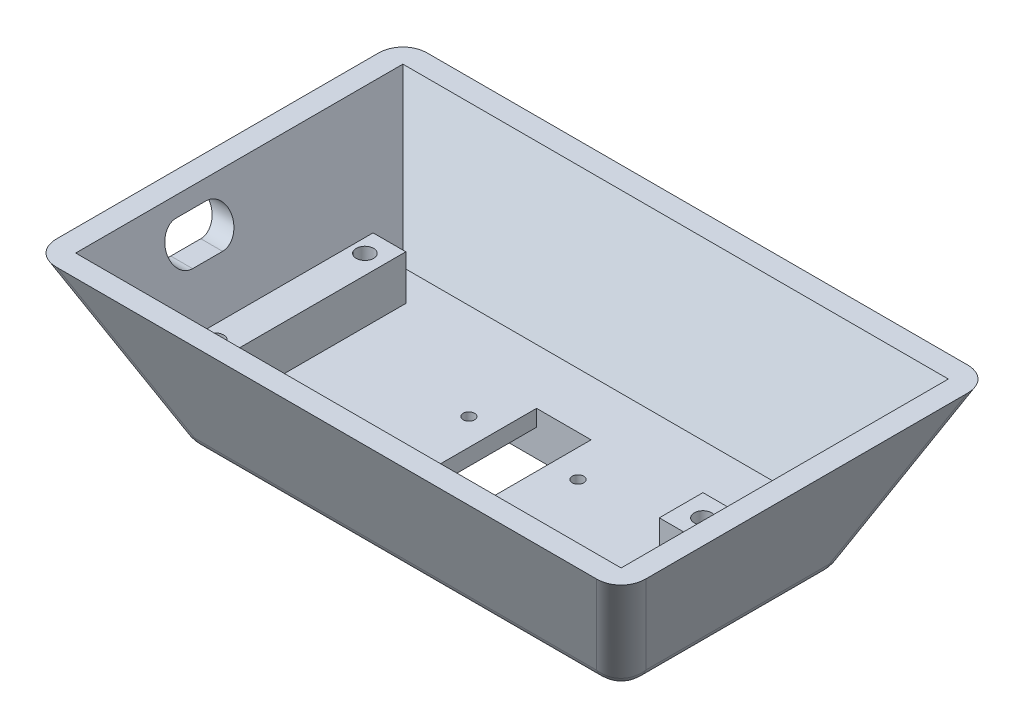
from build123d import *

# Parameters (mm, degrees)
SKETCH1_W                    = 80
SKETCH1_H                    = 40
BASE_EXTRUSION_DEPTH         = 30
BASE_EXTRUSION_DRAFT         = -25
SKETCH2_W                    = 30.2
SKETCH2_H                    = 19.2
TRIANGLE_ATTACH_CUTOUT_DEPTH = 5
SKETCH3_W                    = 99.97845949
SKETCH3_H                    = 59.97845949
SHELL_OUT_THE_BASE_DEPTH     = 22
SHELL_OUT_THE_BASE_DRAFT     = -25
LED_STRIP_CUTOUT_REACH       = 70.521
SKETCH5_R                    = 1.05
SKETCH5_W                    = 10
SKETCH5_H                    = 19.2
PCB_START                    = 8
SKETCH13_W                   = 6
SKETCH13_H                   = 34
SKETCH13_R                   = 1.6002
SKETCH13_W_2                 = 8
SKETCH13_H_2                 = 8
PCB_LEDGE_DEPTH              = 8.2
USB_C_CUTOUT_REACH           = 72.499
FILLET1_R                    = 5


with BuildPart() as part:
    # Sketch1 → Base Extrusion (with draft: the straight prism first)
    with BuildSketch(Plane(origin=(0, 0, 0), x_dir=(1, 0, 0), z_dir=(0, 1, 0))):
        Rectangle(SKETCH1_W, SKETCH1_H)
    extrude(amount=BASE_EXTRUSION_DEPTH)
    # Base Extrusion: the draft: its side faces are tilted about the plane it starts from
    base_extrusion_sides = [part.faces().sort_by_distance(p)[0] for p in [
        (-40, 15, 0),
        (0, 15, 20),
        (40, 15, 0),
        (0, 15, -20),
    ]]
    draft(base_extrusion_sides, Plane(origin=(0, 0, 0), x_dir=(1, 0, 0), z_dir=(0, 1, 0)), BASE_EXTRUSION_DRAFT)

    # Sketch2 → Triangle Attach Cutout (cut)
    with BuildSketch(Plane.XZ):
        Rectangle(SKETCH2_W, SKETCH2_H)
    extrude(amount=-TRIANGLE_ATTACH_CUTOUT_DEPTH, mode=Mode.SUBTRACT)


with BuildPart() as shell_out_the_base_tool:
    # Sketch3 → Shell out the base (with draft: the straight prism first)
    with BuildSketch(Plane(origin=(0, 30, 0), x_dir=(1, 0, 0), z_dir=(0, 1, 0))):
        Rectangle(SKETCH3_W, SKETCH3_H)
    extrude(amount=-SHELL_OUT_THE_BASE_DEPTH)
    # Shell out the base: the draft: its side faces are tilted about the plane it starts from
    shell_out_the_base_sides = [shell_out_the_base_tool.faces().sort_by_distance(p)[0] for p in [
        (-49.989229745, 19, 0),
        (0, 19, 29.989229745),
        (49.989229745, 19, 0),
        (0, 19, -29.989229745),
    ]]
    draft(shell_out_the_base_sides, Plane(origin=(0, 30, 0), x_dir=(1, 0, 0), z_dir=(0, 1, 0)), SHELL_OUT_THE_BASE_DRAFT)


with BuildPart() as part_1:
    add(part.part)

    # Shell out the base: cut by shell_out_the_base_tool
    add(shell_out_the_base_tool.part, mode=Mode.SUBTRACT)

    # Sketch5 → LED Strip Cutout (cut, up to next)
    with BuildSketch(Plane.XZ.offset(-5), mode=Mode.PRIVATE) as led_strip_cutout_sk1:
        with Locations(Location((-10, -2.1, 0), (0, 0, 270))):
            Circle(SKETCH5_R)
    led_strip_cutout_tool1 = extrude(led_strip_cutout_sk1.sketch, amount=-LED_STRIP_CUTOUT_REACH, mode=Mode.PRIVATE) & part_1.part
    # Sketch5 → LED Strip Cutout (cut, up to next)
    with BuildSketch(Plane.XZ.offset(-5), mode=Mode.PRIVATE) as led_strip_cutout_sk2:
        with Locations(Location((10, -2.1, 0), (0, 0, 90))):
            Circle(SKETCH5_R)
    led_strip_cutout_tool2 = extrude(led_strip_cutout_sk2.sketch, amount=-LED_STRIP_CUTOUT_REACH, mode=Mode.PRIVATE) & part_1.part
    # Sketch5 → LED Strip Cutout (cut, up to next)
    with BuildSketch(Plane.XZ.offset(-5), mode=Mode.PRIVATE) as led_strip_cutout_sk3:
        with Locations((-0.1, 0)):
            Rectangle(SKETCH5_W, SKETCH5_H)
    led_strip_cutout_tool3 = extrude(led_strip_cutout_sk3.sketch, amount=-LED_STRIP_CUTOUT_REACH, mode=Mode.PRIVATE) & part_1.part
    add(led_strip_cutout_tool1.solids().sort_by_distance((-10, 5, -2.1))[0], mode=Mode.SUBTRACT)
    add(led_strip_cutout_tool2.solids().sort_by_distance((10, 5, -2.1))[0], mode=Mode.SUBTRACT)
    add(led_strip_cutout_tool3.solids().sort_by_distance((-0.1, 5, 0))[0], mode=Mode.SUBTRACT)

    # Sketch13 → PCB Ledge (add)
    # profile 1 of 2: a face of its own
    with BuildSketch(Plane(origin=(0, 0, 0), x_dir=(1, 0, 0), z_dir=(0, 1, 0)).offset(PCB_START)):
        with Locations((-36.730461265, -2.730461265)):
            Rectangle(SKETCH13_W, SKETCH13_H)
        with Locations(Location((-37.230461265, 10.269538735, 0), (0, 0, 270))):
            Circle(SKETCH13_R, mode=Mode.SUBTRACT)
        with Locations(Location((-37.230461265, -17.230461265, 0), (0, 0, 270))):
            Circle(SKETCH13_R, mode=Mode.SUBTRACT)
    # profile 2 of 2: a face of its own
    with BuildSketch(Plane(origin=(0, 0, 0), x_dir=(1, 0, 0), z_dir=(0, 1, 0)).offset(PCB_START)):
        with Locations((35.730461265, -0.730461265)):
            Rectangle(SKETCH13_W_2, SKETCH13_H_2)
        with Locations(Location((35.730461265, -0.730461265, 0), (0, 0, 270))):
            Circle(SKETCH13_R, mode=Mode.SUBTRACT)
    extrude(amount=PCB_LEDGE_DEPTH)

    # USB-C Cutout: up to this plane
    usb_c_cutout_end = Plane(origin=(-40, 0, -20), z_dir=(-0.9063077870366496, -0.4226182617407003, 0))
    # Sketch14 → USB-C Cutout (cut, up to the surface)
    with BuildSketch(Plane(origin=(0, 0, 0), x_dir=(0, 0, -1), z_dir=(1, 0, 0)), mode=Mode.PRIVATE) as usb_c_cutout_sk1:
        with BuildLine():
            Line((-12.75, 27.5), (-7.25, 27.5))
            ThreePointArc((-7.25, 27.5), (-4, 24.25), (-7.25, 21))
            Line((-7.25, 21), (-12.75, 21))
            ThreePointArc((-12.75, 21), (-16, 24.25), (-12.75, 27.5))
        make_face()
    usb_c_cutout_tool1 = split(extrude(usb_c_cutout_sk1.sketch, amount=-USB_C_CUTOUT_REACH, mode=Mode.PRIVATE), bisect_by=usb_c_cutout_end, keep=Keep.BOTH, mode=Mode.PRIVATE)
    add(usb_c_cutout_tool1.solids().sort_by_distance((0, 24.25, 10))[0], mode=Mode.SUBTRACT)

    # Fillet1
    fillet1_edges = [part_1.edges().sort_by_distance(p)[0] for p in [
        (0, 0, 20),
        (-40, 0, 0),
        (0, 0, -20),
        (40, 0, 0),
        (46.994614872, 15, 26.994614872),
        (-46.994614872, 15, 26.994614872),
        (-46.994614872, 15, -26.994614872),
        (46.994614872, 15, -26.994614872),
    ]]
    fillet(fillet1_edges, radius=FILLET1_R)


solid = part_1.part
